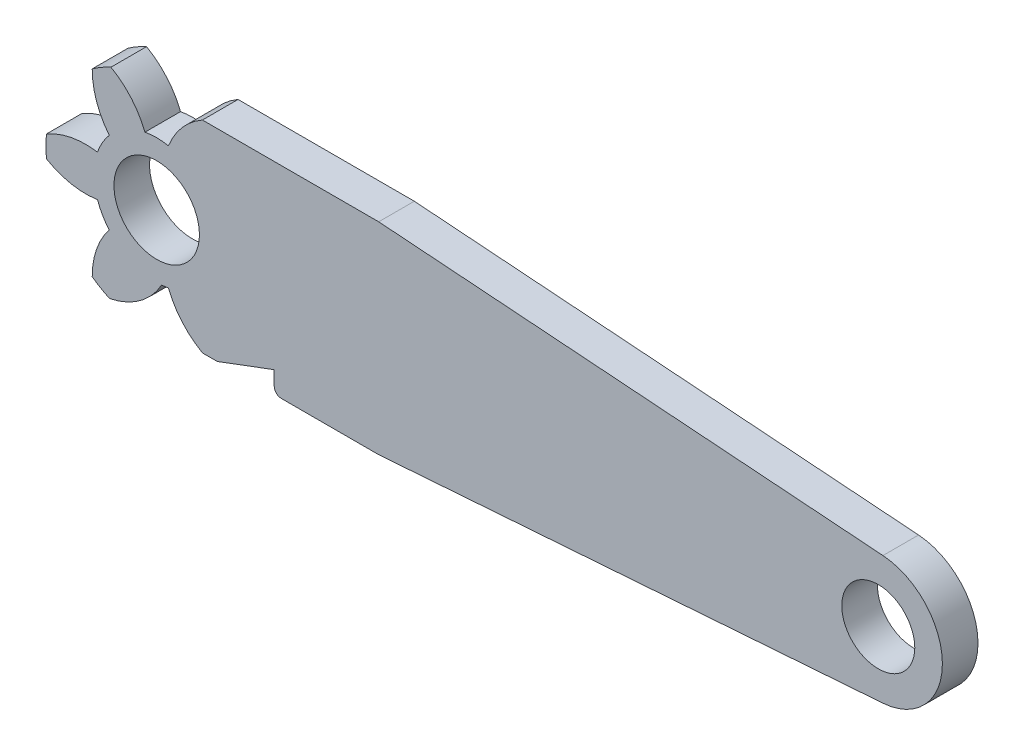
ISO-10303-21;
HEADER;
FILE_DESCRIPTION(('STEP AP214'),'2;1');
FILE_NAME('part.step','',(''),(''),'','','');
FILE_SCHEMA(('AUTOMOTIVE_DESIGN { 1 0 10303 214 1 1 1 1 }'));
ENDSEC;
DATA;
#1=APPLICATION_CONTEXT('core data for automotive mechanical design processes');
#2=APPLICATION_PROTOCOL_DEFINITION('international standard','automotive_design',2000,#1);
#3=PRODUCT_CONTEXT('',#1,'mechanical');
#4=PRODUCT('Part','Part','',(#3));
#5=PRODUCT_RELATED_PRODUCT_CATEGORY('part','',(#4));
#6=PRODUCT_DEFINITION_FORMATION('','',#4);
#7=PRODUCT_DEFINITION_CONTEXT('part definition',#1,'design');
#8=PRODUCT_DEFINITION('design','',#6,#7);
#9=PRODUCT_DEFINITION_SHAPE('','',#8);
#10=(LENGTH_UNIT() NAMED_UNIT(*) SI_UNIT(.MILLI.,.METRE.));
#11=(NAMED_UNIT(*) PLANE_ANGLE_UNIT() SI_UNIT($,.RADIAN.));
#12=(NAMED_UNIT(*) SI_UNIT($,.STERADIAN.) SOLID_ANGLE_UNIT());
#13=UNCERTAINTY_MEASURE_WITH_UNIT(LENGTH_MEASURE(1.E-05),#10,'distance_accuracy_value','');
#14=(GEOMETRIC_REPRESENTATION_CONTEXT(3) GLOBAL_UNCERTAINTY_ASSIGNED_CONTEXT((#13)) GLOBAL_UNIT_ASSIGNED_CONTEXT((#10,
#11,#12)) REPRESENTATION_CONTEXT('',''));
#15=CARTESIAN_POINT('',(0.,0.,0.));
#16=DIRECTION('',(0.,0.,1.));
#17=DIRECTION('',(1.,0.,0.));
#18=AXIS2_PLACEMENT_3D('',#15,#16,#17);
#19=CARTESIAN_POINT('',(82.8787948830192,208.830726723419,5.));
#20=DIRECTION('',(0.,0.,1.));
#21=DIRECTION('',(1.,0.,0.));
#22=AXIS2_PLACEMENT_3D('',#19,#20,#21);
#23=PLANE('',#22);
#24=CARTESIAN_POINT('',(82.8787948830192,208.830726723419,5.));
#25=DIRECTION('',(0.,0.,1.));
#26=DIRECTION('',(1.,0.,0.));
#27=AXIS2_PLACEMENT_3D('',#24,#25,#26);
#28=CIRCLE('',#27,6.00000000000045);
#29=CARTESIAN_POINT('',(88.8787948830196,208.830726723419,5.));
#30=VERTEX_POINT('',#29);
#31=EDGE_CURVE('E248',#30,#30,#28,.T.);
#32=ORIENTED_EDGE('',*,*,#31,.F.);
#33=EDGE_LOOP('',(#32));
#34=FACE_BOUND('',#33,.T.);
#35=CARTESIAN_POINT('',(82.8787948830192,208.830726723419,5.));
#36=DIRECTION('',(0.,0.,1.));
#37=DIRECTION('',(1.,0.,0.));
#38=AXIS2_PLACEMENT_3D('',#35,#36,#37);
#39=CIRCLE('',#38,8.79739096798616);
#40=CARTESIAN_POINT('',(84.5313628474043,217.471508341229,5.));
#41=VERTEX_POINT('',#40);
#42=CARTESIAN_POINT('',(81.2262269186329,217.47150834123,5.));
#43=VERTEX_POINT('',#42);
#44=EDGE_CURVE('E315',#41,#43,#39,.T.);
#45=ORIENTED_EDGE('',*,*,#44,.T.);
#46=CARTESIAN_POINT('',(71.0443966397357,213.49267407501,5.));
#47=DIRECTION('',(0.,0.,1.));
#48=DIRECTION('',(1.,0.,0.));
#49=AXIS2_PLACEMENT_3D('',#46,#47,#48);
#50=CIRCLE('',#49,10.9316416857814);
#51=CARTESIAN_POINT('',(76.4573804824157,222.990062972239,5.));
#52=VERTEX_POINT('',#51);
#53=EDGE_CURVE('E154',#43,#52,#50,.T.);
#54=ORIENTED_EDGE('',*,*,#53,.T.);
#55=CARTESIAN_POINT('',(82.8787948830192,208.830726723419,5.));
#56=DIRECTION('',(0.,0.,1.));
#57=DIRECTION('',(1.,0.,0.));
#58=AXIS2_PLACEMENT_3D('',#55,#56,#57);
#59=CIRCLE('',#58,15.5473909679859);
#60=CARTESIAN_POINT('',(73.8271571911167,221.471502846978,5.));
#61=VERTEX_POINT('',#60);
#62=EDGE_CURVE('E400',#52,#61,#59,.T.);
#63=ORIENTED_EDGE('',*,*,#62,.T.);
#64=CARTESIAN_POINT('',(84.7586291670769,221.4105899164,5.));
#65=DIRECTION('',(0.,0.,1.));
#66=DIRECTION('',(1.,0.,0.));
#67=AXIS2_PLACEMENT_3D('',#64,#65,#66);
#68=CIRCLE('',#67,10.9316416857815);
#69=CARTESIAN_POINT('',(76.2219424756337,214.582283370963,5.));
#70=VERTEX_POINT('',#69);
#71=EDGE_CURVE('E420',#61,#70,#68,.T.);
#72=ORIENTED_EDGE('',*,*,#71,.T.);
#73=CARTESIAN_POINT('',(82.8787948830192,208.830726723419,5.));
#74=DIRECTION('',(0.,0.,1.));
#75=DIRECTION('',(1.,0.,0.));
#76=AXIS2_PLACEMENT_3D('',#73,#74,#75);
#77=CIRCLE('',#76,8.79739096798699);
#78=CARTESIAN_POINT('',(74.569374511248,211.719951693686,5.));
#79=VERTEX_POINT('',#78);
#80=EDGE_CURVE('E416',#70,#79,#77,.T.);
#81=ORIENTED_EDGE('',*,*,#80,.T.);
#82=CARTESIAN_POINT('',(72.924230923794,200.91281088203,5.));
#83=DIRECTION('',(0.,0.,1.));
#84=DIRECTION('',(1.,0.,0.));
#85=AXIS2_PLACEMENT_3D('',#82,#83,#84);
#86=CIRCLE('',#85,10.9316416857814);
#87=CARTESIAN_POINT('',(67.4057427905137,210.349286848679,5.));
#88=VERTEX_POINT('',#87);
#89=EDGE_CURVE('E419',#79,#88,#86,.T.);
#90=ORIENTED_EDGE('',*,*,#89,.T.);
#91=CARTESIAN_POINT('',(82.8787948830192,208.830726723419,5.));
#92=DIRECTION('',(0.,0.,1.));
#93=DIRECTION('',(1.,0.,0.));
#94=AXIS2_PLACEMENT_3D('',#91,#92,#93);
#95=CIRCLE('',#94,15.5473909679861);
#96=CARTESIAN_POINT('',(67.4057427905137,207.312166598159,5.));
#97=VERTEX_POINT('',#96);
#98=EDGE_CURVE('E424',#88,#97,#95,.T.);
#99=ORIENTED_EDGE('',*,*,#98,.T.);
#100=CARTESIAN_POINT('',(72.924230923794,216.748642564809,5.));
#101=DIRECTION('',(0.,0.,1.));
#102=DIRECTION('',(1.,0.,0.));
#103=AXIS2_PLACEMENT_3D('',#100,#101,#102);
#104=CIRCLE('',#103,10.9316416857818);
#105=CARTESIAN_POINT('',(74.5693745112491,205.941501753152,5.));
#106=VERTEX_POINT('',#105);
#107=EDGE_CURVE('E431',#97,#106,#104,.T.);
#108=ORIENTED_EDGE('',*,*,#107,.T.);
#109=CARTESIAN_POINT('',(82.8787948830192,208.830726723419,5.));
#110=DIRECTION('',(0.,0.,1.));
#111=DIRECTION('',(1.,0.,0.));
#112=AXIS2_PLACEMENT_3D('',#109,#110,#111);
#113=CIRCLE('',#112,8.79739096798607);
#114=CARTESIAN_POINT('',(76.2219424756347,203.079170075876,5.));
#115=VERTEX_POINT('',#114);
#116=EDGE_CURVE('E434',#106,#115,#113,.T.);
#117=ORIENTED_EDGE('',*,*,#116,.T.);
#118=CARTESIAN_POINT('',(84.7586291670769,196.250863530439,5.));
#119=DIRECTION('',(0.,0.,1.));
#120=DIRECTION('',(1.,0.,0.));
#121=AXIS2_PLACEMENT_3D('',#118,#119,#120);
#122=CIRCLE('',#121,10.9316416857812);
#123=CARTESIAN_POINT('',(73.827157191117,196.18995059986,5.));
#124=VERTEX_POINT('',#123);
#125=EDGE_CURVE('E437',#115,#124,#122,.T.);
#126=ORIENTED_EDGE('',*,*,#125,.T.);
#127=CARTESIAN_POINT('',(82.8787948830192,208.830726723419,5.));
#128=DIRECTION('',(0.,0.,1.));
#129=DIRECTION('',(1.,0.,0.));
#130=AXIS2_PLACEMENT_3D('',#127,#128,#129);
#131=CIRCLE('',#130,15.5473909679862);
#132=CARTESIAN_POINT('',(76.2561859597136,194.764369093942,5.));
#133=VERTEX_POINT('',#132);
#134=EDGE_CURVE('E440',#124,#133,#131,.T.);
#135=ORIENTED_EDGE('',*,*,#134,.T.);
#136=CARTESIAN_POINT('',(74.165368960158,205.360051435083,5.));
#137=DIRECTION('',(0.,0.,1.));
#138=DIRECTION('',(1.,0.,0.));
#139=AXIS2_PLACEMENT_3D('',#136,#137,#138);
#140=CIRCLE('',#139,10.8);
#141=CARTESIAN_POINT('',(83.5760081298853,200.06100714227,5.));
#142=VERTEX_POINT('',#141);
#143=EDGE_CURVE('E443',#133,#142,#140,.T.);
#144=ORIENTED_EDGE('',*,*,#143,.T.);
#145=CARTESIAN_POINT('',(82.8787948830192,208.830726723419,5.));
#146=DIRECTION('',(0.,0.,1.));
#147=DIRECTION('',(1.,0.,0.));
#148=AXIS2_PLACEMENT_3D('',#145,#146,#147);
#149=CIRCLE('',#148,8.79739096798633);
#150=CARTESIAN_POINT('',(84.5313628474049,200.189945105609,5.));
#151=VERTEX_POINT('',#150);
#152=EDGE_CURVE('E446',#142,#151,#149,.T.);
#153=ORIENTED_EDGE('',*,*,#152,.T.);
#154=CARTESIAN_POINT('',(94.7131931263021,204.168779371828,5.));
#155=DIRECTION('',(0.,0.,1.));
#156=DIRECTION('',(1.,0.,0.));
#157=AXIS2_PLACEMENT_3D('',#154,#155,#156);
#158=CIRCLE('',#157,10.9316416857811);
#159=CARTESIAN_POINT('',(89.3002092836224,194.671390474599,5.));
#160=VERTEX_POINT('',#159);
#161=EDGE_CURVE('E449',#151,#160,#158,.T.);
#162=ORIENTED_EDGE('',*,*,#161,.T.);
#163=DIRECTION('',(1.,0.,0.));
#164=VECTOR('',#163,1.);
#165=CARTESIAN_POINT('',(89.3002092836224,194.671390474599,5.));
#166=LINE('',#165,#164);
#167=CARTESIAN_POINT('',(91.3801110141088,194.671390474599,5.));
#168=VERTEX_POINT('',#167);
#169=EDGE_CURVE('E452',#160,#168,#166,.T.);
#170=ORIENTED_EDGE('',*,*,#169,.T.);
#171=DIRECTION('',(0.936329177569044,0.351123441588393,0.));
#172=VECTOR('',#171,1.);
#173=CARTESIAN_POINT('',(99.3801110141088,197.671390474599,5.));
#174=LINE('',#173,#172);
#175=CARTESIAN_POINT('',(99.3801110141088,197.671390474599,5.));
#176=VERTEX_POINT('',#175);
#177=EDGE_CURVE('E455',#168,#176,#174,.T.);
#178=ORIENTED_EDGE('',*,*,#177,.T.);
#179=DIRECTION('',(0.,-1.,0.));
#180=VECTOR('',#179,1.);
#181=CARTESIAN_POINT('',(99.3801110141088,197.671390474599,5.));
#182=LINE('',#181,#180);
#183=CARTESIAN_POINT('',(99.3801110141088,195.671390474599,5.));
#184=VERTEX_POINT('',#183);
#185=EDGE_CURVE('E458',#176,#184,#182,.T.);
#186=ORIENTED_EDGE('',*,*,#185,.T.);
#187=CARTESIAN_POINT('',(100.380111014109,195.671390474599,5.));
#188=DIRECTION('',(0.,0.,1.));
#189=DIRECTION('',(1.,0.,0.));
#190=AXIS2_PLACEMENT_3D('',#187,#188,#189);
#191=CIRCLE('',#190,1.);
#192=CARTESIAN_POINT('',(100.380111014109,194.671390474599,5.));
#193=VERTEX_POINT('',#192);
#194=EDGE_CURVE('E461',#184,#193,#191,.T.);
#195=ORIENTED_EDGE('',*,*,#194,.T.);
#196=DIRECTION('',(1.,0.,0.));
#197=VECTOR('',#196,1.);
#198=CARTESIAN_POINT('',(100.380111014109,194.671390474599,5.));
#199=LINE('',#198,#197);
#200=CARTESIAN_POINT('',(114.048794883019,194.671390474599,5.));
#201=VERTEX_POINT('',#200);
#202=EDGE_CURVE('E464',#193,#201,#199,.T.);
#203=ORIENTED_EDGE('',*,*,#202,.T.);
#204=DIRECTION('',(0.997330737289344,0.0730164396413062,0.));
#205=VECTOR('',#204,1.);
#206=CARTESIAN_POINT('',(114.048794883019,194.671390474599,5.));
#207=LINE('',#206,#205);
#208=CARTESIAN_POINT('',(184.841758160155,199.854275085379,5.));
#209=VERTEX_POINT('',#208);
#210=EDGE_CURVE('E467',#201,#209,#207,.T.);
#211=ORIENTED_EDGE('',*,*,#210,.T.);
#212=CARTESIAN_POINT('',(184.184610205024,208.830251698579,5.));
#213=DIRECTION('',(0.,0.,1.));
#214=DIRECTION('',(1.,0.,0.));
#215=AXIS2_PLACEMENT_3D('',#212,#213,#214);
#216=CIRCLE('',#215,8.99999997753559);
#217=CARTESIAN_POINT('',(184.841758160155,217.806228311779,5.));
#218=VERTEX_POINT('',#217);
#219=EDGE_CURVE('E221',#209,#218,#216,.T.);
#220=ORIENTED_EDGE('',*,*,#219,.T.);
#221=DIRECTION('',(-0.997330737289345,0.0730164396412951,0.));
#222=VECTOR('',#221,1.);
#223=CARTESIAN_POINT('',(114.048794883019,222.989112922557,5.));
#224=LINE('',#223,#222);
#225=CARTESIAN_POINT('',(114.048794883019,222.989112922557,5.));
#226=VERTEX_POINT('',#225);
#227=EDGE_CURVE('E215',#218,#226,#224,.T.);
#228=ORIENTED_EDGE('',*,*,#227,.T.);
#229=DIRECTION('',(-0.999999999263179,3.83880394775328E-05,0.));
#230=VECTOR('',#229,1.);
#231=CARTESIAN_POINT('',(114.048794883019,222.989112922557,5.));
#232=LINE('',#231,#230);
#233=CARTESIAN_POINT('',(89.3002092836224,222.990062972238,5.));
#234=VERTEX_POINT('',#233);
#235=EDGE_CURVE('E219',#226,#234,#232,.T.);
#236=ORIENTED_EDGE('',*,*,#235,.T.);
#237=CARTESIAN_POINT('',(94.7131931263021,213.49267407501,5.));
#238=DIRECTION('',(0.,0.,1.));
#239=DIRECTION('',(1.,0.,0.));
#240=AXIS2_PLACEMENT_3D('',#237,#238,#239);
#241=CIRCLE('',#240,10.9316416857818);
#242=EDGE_CURVE('E63',#234,#41,#241,.T.);
#243=ORIENTED_EDGE('',*,*,#242,.T.);
#244=EDGE_LOOP('',(#45,#54,#63,#72,#81,#90,#99,#108,#117,#126,#135,#144,#153,#162,#170,#178,
#186,#195,#203,#211,#220,#228,#236,#243));
#245=FACE_BOUND('',#244,.T.);
#246=CARTESIAN_POINT('',(184.184610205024,208.830251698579,5.));
#247=DIRECTION('',(0.,0.,1.));
#248=DIRECTION('',(1.,0.,0.));
#249=AXIS2_PLACEMENT_3D('',#246,#247,#248);
#250=CIRCLE('',#249,5.12499999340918);
#251=CARTESIAN_POINT('',(189.309610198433,208.830251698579,5.));
#252=VERTEX_POINT('',#251);
#253=EDGE_CURVE('E511',#252,#252,#250,.T.);
#254=ORIENTED_EDGE('',*,*,#253,.F.);
#255=EDGE_LOOP('',(#254));
#256=FACE_BOUND('',#255,.T.);
#257=ADVANCED_FACE('F45',(#34,#245,#256),#23,.T.);
#258=CARTESIAN_POINT('',(82.8787948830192,208.830726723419,0.));
#259=DIRECTION('',(0.,0.,1.));
#260=DIRECTION('',(1.,0.,0.));
#261=AXIS2_PLACEMENT_3D('',#258,#259,#260);
#262=PLANE('',#261);
#263=CARTESIAN_POINT('',(82.8787948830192,208.830726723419,0.));
#264=DIRECTION('',(0.,0.,1.));
#265=DIRECTION('',(1.,0.,0.));
#266=AXIS2_PLACEMENT_3D('',#263,#264,#265);
#267=CIRCLE('',#266,8.79739096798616);
#268=CARTESIAN_POINT('',(84.5313628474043,217.471508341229,0.));
#269=VERTEX_POINT('',#268);
#270=CARTESIAN_POINT('',(81.2262269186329,217.47150834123,0.));
#271=VERTEX_POINT('',#270);
#272=EDGE_CURVE('E243',#269,#271,#267,.T.);
#273=ORIENTED_EDGE('',*,*,#272,.F.);
#274=CARTESIAN_POINT('',(94.7131931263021,213.49267407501,0.));
#275=DIRECTION('',(0.,0.,1.));
#276=DIRECTION('',(1.,0.,0.));
#277=AXIS2_PLACEMENT_3D('',#274,#275,#276);
#278=CIRCLE('',#277,10.9316416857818);
#279=CARTESIAN_POINT('',(89.3002092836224,222.990062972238,0.));
#280=VERTEX_POINT('',#279);
#281=EDGE_CURVE('E146',#280,#269,#278,.T.);
#282=ORIENTED_EDGE('',*,*,#281,.F.);
#283=DIRECTION('',(-0.999999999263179,3.83880394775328E-05,0.));
#284=VECTOR('',#283,1.);
#285=CARTESIAN_POINT('',(114.048794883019,222.989112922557,0.));
#286=LINE('',#285,#284);
#287=CARTESIAN_POINT('',(114.048794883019,222.989112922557,0.));
#288=VERTEX_POINT('',#287);
#289=EDGE_CURVE('E140',#288,#280,#286,.T.);
#290=ORIENTED_EDGE('',*,*,#289,.F.);
#291=DIRECTION('',(-0.997330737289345,0.0730164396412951,0.));
#292=VECTOR('',#291,1.);
#293=CARTESIAN_POINT('',(114.048794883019,222.989112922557,0.));
#294=LINE('',#293,#292);
#295=CARTESIAN_POINT('',(184.841758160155,217.806228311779,0.));
#296=VERTEX_POINT('',#295);
#297=EDGE_CURVE('E230',#296,#288,#294,.T.);
#298=ORIENTED_EDGE('',*,*,#297,.F.);
#299=CARTESIAN_POINT('',(184.184610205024,208.830251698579,0.));
#300=DIRECTION('',(0.,0.,1.));
#301=DIRECTION('',(1.,0.,0.));
#302=AXIS2_PLACEMENT_3D('',#299,#300,#301);
#303=CIRCLE('',#302,8.99999997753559);
#304=CARTESIAN_POINT('',(184.841758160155,199.854275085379,0.));
#305=VERTEX_POINT('',#304);
#306=EDGE_CURVE('E306',#305,#296,#303,.T.);
#307=ORIENTED_EDGE('',*,*,#306,.F.);
#308=DIRECTION('',(0.997330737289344,0.0730164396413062,0.));
#309=VECTOR('',#308,1.);
#310=CARTESIAN_POINT('',(114.048794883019,194.671390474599,0.));
#311=LINE('',#310,#309);
#312=CARTESIAN_POINT('',(114.048794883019,194.671390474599,0.));
#313=VERTEX_POINT('',#312);
#314=EDGE_CURVE('E303',#313,#305,#311,.T.);
#315=ORIENTED_EDGE('',*,*,#314,.F.);
#316=DIRECTION('',(1.,0.,0.));
#317=VECTOR('',#316,1.);
#318=CARTESIAN_POINT('',(100.380111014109,194.671390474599,0.));
#319=LINE('',#318,#317);
#320=CARTESIAN_POINT('',(100.380111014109,194.671390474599,0.));
#321=VERTEX_POINT('',#320);
#322=EDGE_CURVE('E300',#321,#313,#319,.T.);
#323=ORIENTED_EDGE('',*,*,#322,.F.);
#324=CARTESIAN_POINT('',(100.380111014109,195.671390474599,0.));
#325=DIRECTION('',(0.,0.,1.));
#326=DIRECTION('',(1.,0.,0.));
#327=AXIS2_PLACEMENT_3D('',#324,#325,#326);
#328=CIRCLE('',#327,1.);
#329=CARTESIAN_POINT('',(99.3801110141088,195.671390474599,0.));
#330=VERTEX_POINT('',#329);
#331=EDGE_CURVE('E297',#330,#321,#328,.T.);
#332=ORIENTED_EDGE('',*,*,#331,.F.);
#333=DIRECTION('',(0.,-1.,0.));
#334=VECTOR('',#333,1.);
#335=CARTESIAN_POINT('',(99.3801110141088,196.949890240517,0.));
#336=LINE('',#335,#334);
#337=CARTESIAN_POINT('',(99.3801110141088,197.671390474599,0.));
#338=VERTEX_POINT('',#337);
#339=EDGE_CURVE('E294',#338,#330,#336,.T.);
#340=ORIENTED_EDGE('',*,*,#339,.F.);
#341=DIRECTION('',(0.936329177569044,0.351123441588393,0.));
#342=VECTOR('',#341,1.);
#343=CARTESIAN_POINT('',(99.3801110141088,197.671390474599,0.));
#344=LINE('',#343,#342);
#345=CARTESIAN_POINT('',(91.3801110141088,194.671390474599,0.));
#346=VERTEX_POINT('',#345);
#347=EDGE_CURVE('E290',#346,#338,#344,.T.);
#348=ORIENTED_EDGE('',*,*,#347,.F.);
#349=DIRECTION('',(1.,0.,0.));
#350=VECTOR('',#349,1.);
#351=CARTESIAN_POINT('',(89.3002092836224,194.671390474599,0.));
#352=LINE('',#351,#350);
#353=CARTESIAN_POINT('',(89.3002092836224,194.671390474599,0.));
#354=VERTEX_POINT('',#353);
#355=EDGE_CURVE('E287',#354,#346,#352,.T.);
#356=ORIENTED_EDGE('',*,*,#355,.F.);
#357=CARTESIAN_POINT('',(94.7131931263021,204.168779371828,0.));
#358=DIRECTION('',(0.,0.,1.));
#359=DIRECTION('',(1.,0.,0.));
#360=AXIS2_PLACEMENT_3D('',#357,#358,#359);
#361=CIRCLE('',#360,10.9316416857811);
#362=CARTESIAN_POINT('',(84.5313628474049,200.189945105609,0.));
#363=VERTEX_POINT('',#362);
#364=EDGE_CURVE('E284',#363,#354,#361,.T.);
#365=ORIENTED_EDGE('',*,*,#364,.F.);
#366=CARTESIAN_POINT('',(82.8787948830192,208.830726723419,0.));
#367=DIRECTION('',(0.,0.,1.));
#368=DIRECTION('',(1.,0.,0.));
#369=AXIS2_PLACEMENT_3D('',#366,#367,#368);
#370=CIRCLE('',#369,8.79739096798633);
#371=CARTESIAN_POINT('',(83.5760081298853,200.06100714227,0.));
#372=VERTEX_POINT('',#371);
#373=EDGE_CURVE('E281',#372,#363,#370,.T.);
#374=ORIENTED_EDGE('',*,*,#373,.F.);
#375=CARTESIAN_POINT('',(74.165368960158,205.360051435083,0.));
#376=DIRECTION('',(0.,0.,1.));
#377=DIRECTION('',(1.,0.,0.));
#378=AXIS2_PLACEMENT_3D('',#375,#376,#377);
#379=CIRCLE('',#378,10.8);
#380=CARTESIAN_POINT('',(76.2561859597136,194.764369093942,0.));
#381=VERTEX_POINT('',#380);
#382=EDGE_CURVE('E278',#381,#372,#379,.T.);
#383=ORIENTED_EDGE('',*,*,#382,.F.);
#384=CARTESIAN_POINT('',(82.8787948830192,208.830726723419,0.));
#385=DIRECTION('',(0.,0.,1.));
#386=DIRECTION('',(1.,0.,0.));
#387=AXIS2_PLACEMENT_3D('',#384,#385,#386);
#388=CIRCLE('',#387,15.5473909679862);
#389=CARTESIAN_POINT('',(73.827157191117,196.18995059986,0.));
#390=VERTEX_POINT('',#389);
#391=EDGE_CURVE('E275',#390,#381,#388,.T.);
#392=ORIENTED_EDGE('',*,*,#391,.F.);
#393=CARTESIAN_POINT('',(84.7586291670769,196.250863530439,0.));
#394=DIRECTION('',(0.,0.,1.));
#395=DIRECTION('',(1.,0.,0.));
#396=AXIS2_PLACEMENT_3D('',#393,#394,#395);
#397=CIRCLE('',#396,10.9316416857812);
#398=CARTESIAN_POINT('',(76.2219424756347,203.079170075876,0.));
#399=VERTEX_POINT('',#398);
#400=EDGE_CURVE('E272',#399,#390,#397,.T.);
#401=ORIENTED_EDGE('',*,*,#400,.F.);
#402=CARTESIAN_POINT('',(82.8787948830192,208.830726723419,0.));
#403=DIRECTION('',(0.,0.,1.));
#404=DIRECTION('',(1.,0.,0.));
#405=AXIS2_PLACEMENT_3D('',#402,#403,#404);
#406=CIRCLE('',#405,8.79739096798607);
#407=CARTESIAN_POINT('',(74.5693745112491,205.941501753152,0.));
#408=VERTEX_POINT('',#407);
#409=EDGE_CURVE('E269',#408,#399,#406,.T.);
#410=ORIENTED_EDGE('',*,*,#409,.F.);
#411=CARTESIAN_POINT('',(72.924230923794,216.748642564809,0.));
#412=DIRECTION('',(0.,0.,1.));
#413=DIRECTION('',(1.,0.,0.));
#414=AXIS2_PLACEMENT_3D('',#411,#412,#413);
#415=CIRCLE('',#414,10.9316416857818);
#416=CARTESIAN_POINT('',(67.4057427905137,207.312166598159,0.));
#417=VERTEX_POINT('',#416);
#418=EDGE_CURVE('E266',#417,#408,#415,.T.);
#419=ORIENTED_EDGE('',*,*,#418,.F.);
#420=CARTESIAN_POINT('',(82.8787948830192,208.830726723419,0.));
#421=DIRECTION('',(0.,0.,1.));
#422=DIRECTION('',(1.,0.,0.));
#423=AXIS2_PLACEMENT_3D('',#420,#421,#422);
#424=CIRCLE('',#423,15.5473909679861);
#425=CARTESIAN_POINT('',(67.4057427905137,210.349286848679,0.));
#426=VERTEX_POINT('',#425);
#427=EDGE_CURVE('E263',#426,#417,#424,.T.);
#428=ORIENTED_EDGE('',*,*,#427,.F.);
#429=CARTESIAN_POINT('',(72.924230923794,200.91281088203,0.));
#430=DIRECTION('',(0.,0.,1.));
#431=DIRECTION('',(1.,0.,0.));
#432=AXIS2_PLACEMENT_3D('',#429,#430,#431);
#433=CIRCLE('',#432,10.9316416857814);
#434=CARTESIAN_POINT('',(74.569374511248,211.719951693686,0.));
#435=VERTEX_POINT('',#434);
#436=EDGE_CURVE('E260',#435,#426,#433,.T.);
#437=ORIENTED_EDGE('',*,*,#436,.F.);
#438=CARTESIAN_POINT('',(82.8787948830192,208.830726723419,0.));
#439=DIRECTION('',(0.,0.,1.));
#440=DIRECTION('',(1.,0.,0.));
#441=AXIS2_PLACEMENT_3D('',#438,#439,#440);
#442=CIRCLE('',#441,8.79739096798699);
#443=CARTESIAN_POINT('',(76.2219424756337,214.582283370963,0.));
#444=VERTEX_POINT('',#443);
#445=EDGE_CURVE('E257',#444,#435,#442,.T.);
#446=ORIENTED_EDGE('',*,*,#445,.F.);
#447=CARTESIAN_POINT('',(84.7586291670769,221.4105899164,0.));
#448=DIRECTION('',(0.,0.,1.));
#449=DIRECTION('',(1.,0.,0.));
#450=AXIS2_PLACEMENT_3D('',#447,#448,#449);
#451=CIRCLE('',#450,10.9316416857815);
#452=CARTESIAN_POINT('',(73.8271571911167,221.471502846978,0.));
#453=VERTEX_POINT('',#452);
#454=EDGE_CURVE('E254',#453,#444,#451,.T.);
#455=ORIENTED_EDGE('',*,*,#454,.F.);
#456=CARTESIAN_POINT('',(82.8787948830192,208.830726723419,0.));
#457=DIRECTION('',(0.,0.,1.));
#458=DIRECTION('',(1.,0.,0.));
#459=AXIS2_PLACEMENT_3D('',#456,#457,#458);
#460=CIRCLE('',#459,15.5473909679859);
#461=CARTESIAN_POINT('',(76.4573804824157,222.990062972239,0.));
#462=VERTEX_POINT('',#461);
#463=EDGE_CURVE('E251',#462,#453,#460,.T.);
#464=ORIENTED_EDGE('',*,*,#463,.F.);
#465=CARTESIAN_POINT('',(71.0443966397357,213.49267407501,0.));
#466=DIRECTION('',(0.,0.,1.));
#467=DIRECTION('',(1.,0.,0.));
#468=AXIS2_PLACEMENT_3D('',#465,#466,#467);
#469=CIRCLE('',#468,10.9316416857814);
#470=EDGE_CURVE('E247',#271,#462,#469,.T.);
#471=ORIENTED_EDGE('',*,*,#470,.F.);
#472=EDGE_LOOP('',(#273,#282,#290,#298,#307,#315,#323,#332,#340,#348,#356,#365,#374,#383,#392,
#401,#410,#419,#428,#437,#446,#455,#464,#471));
#473=FACE_BOUND('',#472,.T.);
#474=CARTESIAN_POINT('',(82.8787948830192,208.830726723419,0.));
#475=DIRECTION('',(0.,0.,1.));
#476=DIRECTION('',(1.,0.,0.));
#477=AXIS2_PLACEMENT_3D('',#474,#475,#476);
#478=CIRCLE('',#477,6.00000000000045);
#479=CARTESIAN_POINT('',(88.8787948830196,208.830726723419,0.));
#480=VERTEX_POINT('',#479);
#481=EDGE_CURVE('E519',#480,#480,#478,.T.);
#482=ORIENTED_EDGE('',*,*,#481,.T.);
#483=EDGE_LOOP('',(#482));
#484=FACE_BOUND('',#483,.T.);
#485=CARTESIAN_POINT('',(184.184610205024,208.830251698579,0.));
#486=DIRECTION('',(0.,0.,1.));
#487=DIRECTION('',(1.,0.,0.));
#488=AXIS2_PLACEMENT_3D('',#485,#486,#487);
#489=CIRCLE('',#488,5.12499999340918);
#490=CARTESIAN_POINT('',(189.309610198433,208.830251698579,0.));
#491=VERTEX_POINT('',#490);
#492=EDGE_CURVE('E514',#491,#491,#489,.T.);
#493=ORIENTED_EDGE('',*,*,#492,.T.);
#494=EDGE_LOOP('',(#493));
#495=FACE_BOUND('',#494,.T.);
#496=ADVANCED_FACE('F404',(#473,#484,#495),#262,.F.);
#497=CARTESIAN_POINT('',(82.8787948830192,208.830726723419,5.));
#498=DIRECTION('',(0.,0.,-1.));
#499=DIRECTION('',(-1.,0.,0.));
#500=AXIS2_PLACEMENT_3D('',#497,#498,#499);
#501=CYLINDRICAL_SURFACE('',#500,8.79739096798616);
#502=ORIENTED_EDGE('',*,*,#272,.T.);
#503=DIRECTION('',(0.,0.,-1.));
#504=VECTOR('',#503,1.);
#505=CARTESIAN_POINT('',(81.2262269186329,217.47150834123,5.));
#506=LINE('',#505,#504);
#507=EDGE_CURVE('E11',#43,#271,#506,.T.);
#508=ORIENTED_EDGE('',*,*,#507,.F.);
#509=ORIENTED_EDGE('',*,*,#44,.F.);
#510=DIRECTION('',(0.,0.,-1.));
#511=VECTOR('',#510,1.);
#512=CARTESIAN_POINT('',(84.5313628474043,217.471508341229,5.));
#513=LINE('',#512,#511);
#514=EDGE_CURVE('E239',#41,#269,#513,.T.);
#515=ORIENTED_EDGE('',*,*,#514,.T.);
#516=EDGE_LOOP('',(#502,#508,#509,#515));
#517=FACE_BOUND('',#516,.T.);
#518=ADVANCED_FACE('F47',(#517),#501,.T.);
#519=CARTESIAN_POINT('',(71.0443966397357,213.49267407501,5.));
#520=DIRECTION('',(0.,0.,-1.));
#521=DIRECTION('',(-1.,0.,0.));
#522=AXIS2_PLACEMENT_3D('',#519,#520,#521);
#523=CYLINDRICAL_SURFACE('',#522,10.9316416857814);
#524=ORIENTED_EDGE('',*,*,#470,.T.);
#525=DIRECTION('',(0.,0.,-1.));
#526=VECTOR('',#525,1.);
#527=CARTESIAN_POINT('',(76.4573804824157,222.990062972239,5.));
#528=LINE('',#527,#526);
#529=EDGE_CURVE('E55',#52,#462,#528,.T.);
#530=ORIENTED_EDGE('',*,*,#529,.F.);
#531=ORIENTED_EDGE('',*,*,#53,.F.);
#532=ORIENTED_EDGE('',*,*,#507,.T.);
#533=EDGE_LOOP('',(#524,#530,#531,#532));
#534=FACE_BOUND('',#533,.T.);
#535=ADVANCED_FACE('F747',(#534),#523,.T.);
#536=CARTESIAN_POINT('',(82.8787948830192,208.830726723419,5.));
#537=DIRECTION('',(0.,0.,-1.));
#538=DIRECTION('',(-1.,0.,0.));
#539=AXIS2_PLACEMENT_3D('',#536,#537,#538);
#540=CYLINDRICAL_SURFACE('',#539,15.5473909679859);
#541=ORIENTED_EDGE('',*,*,#463,.T.);
#542=DIRECTION('',(0.,0.,-1.));
#543=VECTOR('',#542,1.);
#544=CARTESIAN_POINT('',(73.8271571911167,221.471502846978,5.));
#545=LINE('',#544,#543);
#546=EDGE_CURVE('E390',#61,#453,#545,.T.);
#547=ORIENTED_EDGE('',*,*,#546,.F.);
#548=ORIENTED_EDGE('',*,*,#62,.F.);
#549=ORIENTED_EDGE('',*,*,#529,.T.);
#550=EDGE_LOOP('',(#541,#547,#548,#549));
#551=FACE_BOUND('',#550,.T.);
#552=ADVANCED_FACE('F398',(#551),#540,.T.);
#553=CARTESIAN_POINT('',(84.7586291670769,221.4105899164,5.));
#554=DIRECTION('',(0.,0.,-1.));
#555=DIRECTION('',(-1.,0.,0.));
#556=AXIS2_PLACEMENT_3D('',#553,#554,#555);
#557=CYLINDRICAL_SURFACE('',#556,10.9316416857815);
#558=ORIENTED_EDGE('',*,*,#454,.T.);
#559=DIRECTION('',(0.,0.,-1.));
#560=VECTOR('',#559,1.);
#561=CARTESIAN_POINT('',(76.2219424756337,214.582283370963,5.));
#562=LINE('',#561,#560);
#563=EDGE_CURVE('E386',#70,#444,#562,.T.);
#564=ORIENTED_EDGE('',*,*,#563,.F.);
#565=ORIENTED_EDGE('',*,*,#71,.F.);
#566=ORIENTED_EDGE('',*,*,#546,.T.);
#567=EDGE_LOOP('',(#558,#564,#565,#566));
#568=FACE_BOUND('',#567,.T.);
#569=ADVANCED_FACE('F410',(#568),#557,.T.);
#570=CARTESIAN_POINT('',(82.8787948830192,208.830726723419,5.));
#571=DIRECTION('',(0.,0.,-1.));
#572=DIRECTION('',(-1.,0.,0.));
#573=AXIS2_PLACEMENT_3D('',#570,#571,#572);
#574=CYLINDRICAL_SURFACE('',#573,8.79739096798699);
#575=ORIENTED_EDGE('',*,*,#445,.T.);
#576=DIRECTION('',(0.,0.,-1.));
#577=VECTOR('',#576,1.);
#578=CARTESIAN_POINT('',(74.569374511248,211.719951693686,5.));
#579=LINE('',#578,#577);
#580=EDGE_CURVE('E382',#79,#435,#579,.T.);
#581=ORIENTED_EDGE('',*,*,#580,.F.);
#582=ORIENTED_EDGE('',*,*,#80,.F.);
#583=ORIENTED_EDGE('',*,*,#563,.T.);
#584=EDGE_LOOP('',(#575,#581,#582,#583));
#585=FACE_BOUND('',#584,.T.);
#586=ADVANCED_FACE('F414',(#585),#574,.T.);
#587=CARTESIAN_POINT('',(72.924230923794,200.91281088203,5.));
#588=DIRECTION('',(0.,0.,-1.));
#589=DIRECTION('',(-1.,0.,0.));
#590=AXIS2_PLACEMENT_3D('',#587,#588,#589);
#591=CYLINDRICAL_SURFACE('',#590,10.9316416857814);
#592=ORIENTED_EDGE('',*,*,#436,.T.);
#593=DIRECTION('',(0.,0.,-1.));
#594=VECTOR('',#593,1.);
#595=CARTESIAN_POINT('',(67.4057427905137,210.349286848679,5.));
#596=LINE('',#595,#594);
#597=EDGE_CURVE('E378',#88,#426,#596,.T.);
#598=ORIENTED_EDGE('',*,*,#597,.F.);
#599=ORIENTED_EDGE('',*,*,#89,.F.);
#600=ORIENTED_EDGE('',*,*,#580,.T.);
#601=EDGE_LOOP('',(#592,#598,#599,#600));
#602=FACE_BOUND('',#601,.T.);
#603=ADVANCED_FACE('F712',(#602),#591,.T.);
#604=CARTESIAN_POINT('',(82.8787948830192,208.830726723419,5.));
#605=DIRECTION('',(0.,0.,-1.));
#606=DIRECTION('',(-1.,0.,0.));
#607=AXIS2_PLACEMENT_3D('',#604,#605,#606);
#608=CYLINDRICAL_SURFACE('',#607,15.5473909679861);
#609=ORIENTED_EDGE('',*,*,#427,.T.);
#610=DIRECTION('',(0.,0.,-1.));
#611=VECTOR('',#610,1.);
#612=CARTESIAN_POINT('',(67.4057427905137,207.312166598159,5.));
#613=LINE('',#612,#611);
#614=EDGE_CURVE('E374',#97,#417,#613,.T.);
#615=ORIENTED_EDGE('',*,*,#614,.F.);
#616=ORIENTED_EDGE('',*,*,#98,.F.);
#617=ORIENTED_EDGE('',*,*,#597,.T.);
#618=EDGE_LOOP('',(#609,#615,#616,#617));
#619=FACE_BOUND('',#618,.T.);
#620=ADVANCED_FACE('F702',(#619),#608,.T.);
#621=CARTESIAN_POINT('',(72.924230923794,216.748642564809,5.));
#622=DIRECTION('',(0.,0.,-1.));
#623=DIRECTION('',(-1.,0.,0.));
#624=AXIS2_PLACEMENT_3D('',#621,#622,#623);
#625=CYLINDRICAL_SURFACE('',#624,10.9316416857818);
#626=ORIENTED_EDGE('',*,*,#418,.T.);
#627=DIRECTION('',(0.,0.,-1.));
#628=VECTOR('',#627,1.);
#629=CARTESIAN_POINT('',(74.5693745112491,205.941501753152,5.));
#630=LINE('',#629,#628);
#631=EDGE_CURVE('E370',#106,#408,#630,.T.);
#632=ORIENTED_EDGE('',*,*,#631,.F.);
#633=ORIENTED_EDGE('',*,*,#107,.F.);
#634=ORIENTED_EDGE('',*,*,#614,.T.);
#635=EDGE_LOOP('',(#626,#632,#633,#634));
#636=FACE_BOUND('',#635,.T.);
#637=ADVANCED_FACE('F692',(#636),#625,.T.);
#638=CARTESIAN_POINT('',(82.8787948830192,208.830726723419,5.));
#639=DIRECTION('',(0.,0.,-1.));
#640=DIRECTION('',(-1.,0.,0.));
#641=AXIS2_PLACEMENT_3D('',#638,#639,#640);
#642=CYLINDRICAL_SURFACE('',#641,8.79739096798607);
#643=ORIENTED_EDGE('',*,*,#409,.T.);
#644=DIRECTION('',(0.,0.,-1.));
#645=VECTOR('',#644,1.);
#646=CARTESIAN_POINT('',(76.2219424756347,203.079170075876,5.));
#647=LINE('',#646,#645);
#648=EDGE_CURVE('E366',#115,#399,#647,.T.);
#649=ORIENTED_EDGE('',*,*,#648,.F.);
#650=ORIENTED_EDGE('',*,*,#116,.F.);
#651=ORIENTED_EDGE('',*,*,#631,.T.);
#652=EDGE_LOOP('',(#643,#649,#650,#651));
#653=FACE_BOUND('',#652,.T.);
#654=ADVANCED_FACE('F682',(#653),#642,.T.);
#655=CARTESIAN_POINT('',(84.7586291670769,196.250863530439,5.));
#656=DIRECTION('',(0.,0.,-1.));
#657=DIRECTION('',(-1.,0.,0.));
#658=AXIS2_PLACEMENT_3D('',#655,#656,#657);
#659=CYLINDRICAL_SURFACE('',#658,10.9316416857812);
#660=ORIENTED_EDGE('',*,*,#400,.T.);
#661=DIRECTION('',(0.,0.,-1.));
#662=VECTOR('',#661,1.);
#663=CARTESIAN_POINT('',(73.827157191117,196.18995059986,5.));
#664=LINE('',#663,#662);
#665=EDGE_CURVE('E362',#124,#390,#664,.T.);
#666=ORIENTED_EDGE('',*,*,#665,.F.);
#667=ORIENTED_EDGE('',*,*,#125,.F.);
#668=ORIENTED_EDGE('',*,*,#648,.T.);
#669=EDGE_LOOP('',(#660,#666,#667,#668));
#670=FACE_BOUND('',#669,.T.);
#671=ADVANCED_FACE('F672',(#670),#659,.T.);
#672=CARTESIAN_POINT('',(82.8787948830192,208.830726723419,5.));
#673=DIRECTION('',(0.,0.,-1.));
#674=DIRECTION('',(-1.,0.,0.));
#675=AXIS2_PLACEMENT_3D('',#672,#673,#674);
#676=CYLINDRICAL_SURFACE('',#675,15.5473909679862);
#677=ORIENTED_EDGE('',*,*,#391,.T.);
#678=DIRECTION('',(0.,0.,-1.));
#679=VECTOR('',#678,1.);
#680=CARTESIAN_POINT('',(76.2561859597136,194.764369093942,5.));
#681=LINE('',#680,#679);
#682=EDGE_CURVE('E358',#133,#381,#681,.T.);
#683=ORIENTED_EDGE('',*,*,#682,.F.);
#684=ORIENTED_EDGE('',*,*,#134,.F.);
#685=ORIENTED_EDGE('',*,*,#665,.T.);
#686=EDGE_LOOP('',(#677,#683,#684,#685));
#687=FACE_BOUND('',#686,.T.);
#688=ADVANCED_FACE('F662',(#687),#676,.T.);
#689=CARTESIAN_POINT('',(74.165368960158,205.360051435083,5.));
#690=DIRECTION('',(0.,0.,-1.));
#691=DIRECTION('',(-1.,0.,0.));
#692=AXIS2_PLACEMENT_3D('',#689,#690,#691);
#693=CYLINDRICAL_SURFACE('',#692,10.8);
#694=ORIENTED_EDGE('',*,*,#382,.T.);
#695=DIRECTION('',(0.,0.,-1.));
#696=VECTOR('',#695,1.);
#697=CARTESIAN_POINT('',(83.5760081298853,200.06100714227,5.));
#698=LINE('',#697,#696);
#699=EDGE_CURVE('E354',#142,#372,#698,.T.);
#700=ORIENTED_EDGE('',*,*,#699,.F.);
#701=ORIENTED_EDGE('',*,*,#143,.F.);
#702=ORIENTED_EDGE('',*,*,#682,.T.);
#703=EDGE_LOOP('',(#694,#700,#701,#702));
#704=FACE_BOUND('',#703,.T.);
#705=ADVANCED_FACE('F652',(#704),#693,.T.);
#706=CARTESIAN_POINT('',(82.8787948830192,208.830726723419,5.));
#707=DIRECTION('',(0.,0.,-1.));
#708=DIRECTION('',(-1.,0.,0.));
#709=AXIS2_PLACEMENT_3D('',#706,#707,#708);
#710=CYLINDRICAL_SURFACE('',#709,8.79739096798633);
#711=ORIENTED_EDGE('',*,*,#373,.T.);
#712=DIRECTION('',(0.,0.,-1.));
#713=VECTOR('',#712,1.);
#714=CARTESIAN_POINT('',(84.5313628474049,200.189945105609,5.));
#715=LINE('',#714,#713);
#716=EDGE_CURVE('E350',#151,#363,#715,.T.);
#717=ORIENTED_EDGE('',*,*,#716,.F.);
#718=ORIENTED_EDGE('',*,*,#152,.F.);
#719=ORIENTED_EDGE('',*,*,#699,.T.);
#720=EDGE_LOOP('',(#711,#717,#718,#719));
#721=FACE_BOUND('',#720,.T.);
#722=ADVANCED_FACE('F642',(#721),#710,.T.);
#723=CARTESIAN_POINT('',(94.7131931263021,204.168779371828,5.));
#724=DIRECTION('',(0.,0.,-1.));
#725=DIRECTION('',(-1.,0.,0.));
#726=AXIS2_PLACEMENT_3D('',#723,#724,#725);
#727=CYLINDRICAL_SURFACE('',#726,10.9316416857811);
#728=ORIENTED_EDGE('',*,*,#364,.T.);
#729=DIRECTION('',(0.,0.,-1.));
#730=VECTOR('',#729,1.);
#731=CARTESIAN_POINT('',(89.3002092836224,194.671390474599,5.));
#732=LINE('',#731,#730);
#733=EDGE_CURVE('E346',#160,#354,#732,.T.);
#734=ORIENTED_EDGE('',*,*,#733,.F.);
#735=ORIENTED_EDGE('',*,*,#161,.F.);
#736=ORIENTED_EDGE('',*,*,#716,.T.);
#737=EDGE_LOOP('',(#728,#734,#735,#736));
#738=FACE_BOUND('',#737,.T.);
#739=ADVANCED_FACE('F632',(#738),#727,.T.);
#740=CARTESIAN_POINT('',(89.3002092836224,194.671390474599,5.));
#741=DIRECTION('',(0.,1.,0.));
#742=DIRECTION('',(0.,0.,1.));
#743=AXIS2_PLACEMENT_3D('',#740,#741,#742);
#744=PLANE('',#743);
#745=ORIENTED_EDGE('',*,*,#355,.T.);
#746=DIRECTION('',(0.,0.,-1.));
#747=VECTOR('',#746,1.);
#748=CARTESIAN_POINT('',(91.3801110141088,194.671390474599,5.));
#749=LINE('',#748,#747);
#750=EDGE_CURVE('E342',#168,#346,#749,.T.);
#751=ORIENTED_EDGE('',*,*,#750,.F.);
#752=ORIENTED_EDGE('',*,*,#169,.F.);
#753=ORIENTED_EDGE('',*,*,#733,.T.);
#754=EDGE_LOOP('',(#745,#751,#752,#753));
#755=FACE_BOUND('',#754,.T.);
#756=ADVANCED_FACE('F622',(#755),#744,.F.);
#757=CARTESIAN_POINT('',(99.3801110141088,197.671390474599,5.));
#758=DIRECTION('',(-0.351123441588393,0.936329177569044,0.));
#759=DIRECTION('',(-0.936329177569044,-0.351123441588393,0.));
#760=AXIS2_PLACEMENT_3D('',#757,#758,#759);
#761=PLANE('',#760);
#762=ORIENTED_EDGE('',*,*,#347,.T.);
#763=DIRECTION('',(0.,0.,-1.));
#764=VECTOR('',#763,1.);
#765=CARTESIAN_POINT('',(99.3801110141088,197.671390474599,5.));
#766=LINE('',#765,#764);
#767=EDGE_CURVE('E338',#176,#338,#766,.T.);
#768=ORIENTED_EDGE('',*,*,#767,.F.);
#769=ORIENTED_EDGE('',*,*,#177,.F.);
#770=ORIENTED_EDGE('',*,*,#750,.T.);
#771=EDGE_LOOP('',(#762,#768,#769,#770));
#772=FACE_BOUND('',#771,.T.);
#773=ADVANCED_FACE('F613',(#772),#761,.F.);
#774=CARTESIAN_POINT('',(99.3801110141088,196.949890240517,5.));
#775=DIRECTION('',(1.,0.,0.));
#776=DIRECTION('',(0.,1.,0.));
#777=AXIS2_PLACEMENT_3D('',#774,#775,#776);
#778=PLANE('',#777);
#779=ORIENTED_EDGE('',*,*,#339,.T.);
#780=DIRECTION('',(0.,0.,-1.));
#781=VECTOR('',#780,1.);
#782=CARTESIAN_POINT('',(99.3801110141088,195.671390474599,5.));
#783=LINE('',#782,#781);
#784=EDGE_CURVE('E334',#184,#330,#783,.T.);
#785=ORIENTED_EDGE('',*,*,#784,.F.);
#786=ORIENTED_EDGE('',*,*,#185,.F.);
#787=ORIENTED_EDGE('',*,*,#767,.T.);
#788=EDGE_LOOP('',(#779,#785,#786,#787));
#789=FACE_BOUND('',#788,.T.);
#790=ADVANCED_FACE('F602',(#789),#778,.F.);
#791=CARTESIAN_POINT('',(100.380111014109,195.671390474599,5.));
#792=DIRECTION('',(0.,0.,-1.));
#793=DIRECTION('',(-1.,0.,0.));
#794=AXIS2_PLACEMENT_3D('',#791,#792,#793);
#795=CYLINDRICAL_SURFACE('',#794,1.);
#796=ORIENTED_EDGE('',*,*,#331,.T.);
#797=DIRECTION('',(0.,0.,-1.));
#798=VECTOR('',#797,1.);
#799=CARTESIAN_POINT('',(100.380111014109,194.671390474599,5.));
#800=LINE('',#799,#798);
#801=EDGE_CURVE('E330',#193,#321,#800,.T.);
#802=ORIENTED_EDGE('',*,*,#801,.F.);
#803=ORIENTED_EDGE('',*,*,#194,.F.);
#804=ORIENTED_EDGE('',*,*,#784,.T.);
#805=EDGE_LOOP('',(#796,#802,#803,#804));
#806=FACE_BOUND('',#805,.T.);
#807=ADVANCED_FACE('F592',(#806),#795,.T.);
#808=CARTESIAN_POINT('',(100.380111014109,194.671390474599,5.));
#809=DIRECTION('',(0.,1.,0.));
#810=DIRECTION('',(0.,0.,1.));
#811=AXIS2_PLACEMENT_3D('',#808,#809,#810);
#812=PLANE('',#811);
#813=ORIENTED_EDGE('',*,*,#322,.T.);
#814=DIRECTION('',(0.,0.,-1.));
#815=VECTOR('',#814,1.);
#816=CARTESIAN_POINT('',(114.048794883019,194.671390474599,5.));
#817=LINE('',#816,#815);
#818=EDGE_CURVE('E326',#201,#313,#817,.T.);
#819=ORIENTED_EDGE('',*,*,#818,.F.);
#820=ORIENTED_EDGE('',*,*,#202,.F.);
#821=ORIENTED_EDGE('',*,*,#801,.T.);
#822=EDGE_LOOP('',(#813,#819,#820,#821));
#823=FACE_BOUND('',#822,.T.);
#824=ADVANCED_FACE('F583',(#823),#812,.F.);
#825=CARTESIAN_POINT('',(114.048794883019,194.671390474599,5.));
#826=DIRECTION('',(-0.0730164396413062,0.997330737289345,0.));
#827=DIRECTION('',(-0.997330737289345,-0.0730164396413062,0.));
#828=AXIS2_PLACEMENT_3D('',#825,#826,#827);
#829=PLANE('',#828);
#830=ORIENTED_EDGE('',*,*,#314,.T.);
#831=DIRECTION('',(0.,0.,-1.));
#832=VECTOR('',#831,1.);
#833=CARTESIAN_POINT('',(184.841758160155,199.854275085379,5.));
#834=LINE('',#833,#832);
#835=EDGE_CURVE('E322',#209,#305,#834,.T.);
#836=ORIENTED_EDGE('',*,*,#835,.F.);
#837=ORIENTED_EDGE('',*,*,#210,.F.);
#838=ORIENTED_EDGE('',*,*,#818,.T.);
#839=EDGE_LOOP('',(#830,#836,#837,#838));
#840=FACE_BOUND('',#839,.T.);
#841=ADVANCED_FACE('F475',(#840),#829,.F.);
#842=CARTESIAN_POINT('',(184.184610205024,208.830251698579,5.));
#843=DIRECTION('',(0.,0.,-1.));
#844=DIRECTION('',(-1.,0.,0.));
#845=AXIS2_PLACEMENT_3D('',#842,#843,#844);
#846=CYLINDRICAL_SURFACE('',#845,8.99999997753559);
#847=ORIENTED_EDGE('',*,*,#306,.T.);
#848=DIRECTION('',(0.,0.,-1.));
#849=VECTOR('',#848,1.);
#850=CARTESIAN_POINT('',(184.841758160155,217.806228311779,5.));
#851=LINE('',#850,#849);
#852=EDGE_CURVE('E232',#218,#296,#851,.T.);
#853=ORIENTED_EDGE('',*,*,#852,.F.);
#854=ORIENTED_EDGE('',*,*,#219,.F.);
#855=ORIENTED_EDGE('',*,*,#835,.T.);
#856=EDGE_LOOP('',(#847,#853,#854,#855));
#857=FACE_BOUND('',#856,.T.);
#858=ADVANCED_FACE('F479',(#857),#846,.T.);
#859=CARTESIAN_POINT('',(114.048794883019,222.989112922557,5.));
#860=DIRECTION('',(-0.0730164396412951,-0.997330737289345,0.));
#861=DIRECTION('',(0.997330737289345,-0.0730164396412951,0.));
#862=AXIS2_PLACEMENT_3D('',#859,#860,#861);
#863=PLANE('',#862);
#864=ORIENTED_EDGE('',*,*,#297,.T.);
#865=DIRECTION('',(0.,0.,-1.));
#866=VECTOR('',#865,1.);
#867=CARTESIAN_POINT('',(114.048794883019,222.989112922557,5.));
#868=LINE('',#867,#866);
#869=EDGE_CURVE('E227',#226,#288,#868,.T.);
#870=ORIENTED_EDGE('',*,*,#869,.F.);
#871=ORIENTED_EDGE('',*,*,#227,.F.);
#872=ORIENTED_EDGE('',*,*,#852,.T.);
#873=EDGE_LOOP('',(#864,#870,#871,#872));
#874=FACE_BOUND('',#873,.T.);
#875=ADVANCED_FACE('F228',(#874),#863,.F.);
#876=CARTESIAN_POINT('',(114.048794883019,222.989112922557,5.));
#877=DIRECTION('',(-3.83880394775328E-05,-0.999999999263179,0.));
#878=DIRECTION('',(0.999999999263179,-3.83880394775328E-05,0.));
#879=AXIS2_PLACEMENT_3D('',#876,#877,#878);
#880=PLANE('',#879);
#881=ORIENTED_EDGE('',*,*,#289,.T.);
#882=DIRECTION('',(0.,0.,-1.));
#883=VECTOR('',#882,1.);
#884=CARTESIAN_POINT('',(89.3002092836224,222.990062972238,5.));
#885=LINE('',#884,#883);
#886=EDGE_CURVE('E233',#234,#280,#885,.T.);
#887=ORIENTED_EDGE('',*,*,#886,.F.);
#888=ORIENTED_EDGE('',*,*,#235,.F.);
#889=ORIENTED_EDGE('',*,*,#869,.T.);
#890=EDGE_LOOP('',(#881,#887,#888,#889));
#891=FACE_BOUND('',#890,.T.);
#892=ADVANCED_FACE('F235',(#891),#880,.F.);
#893=CARTESIAN_POINT('',(94.7131931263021,213.49267407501,5.));
#894=DIRECTION('',(0.,0.,-1.));
#895=DIRECTION('',(-1.,0.,0.));
#896=AXIS2_PLACEMENT_3D('',#893,#894,#895);
#897=CYLINDRICAL_SURFACE('',#896,10.9316416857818);
#898=ORIENTED_EDGE('',*,*,#281,.T.);
#899=ORIENTED_EDGE('',*,*,#514,.F.);
#900=ORIENTED_EDGE('',*,*,#242,.F.);
#901=ORIENTED_EDGE('',*,*,#886,.T.);
#902=EDGE_LOOP('',(#898,#899,#900,#901));
#903=FACE_BOUND('',#902,.T.);
#904=ADVANCED_FACE('F483',(#903),#897,.T.);
#905=CARTESIAN_POINT('',(82.8787948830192,208.830726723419,5.));
#906=DIRECTION('',(0.,0.,-1.));
#907=DIRECTION('',(-1.,0.,0.));
#908=AXIS2_PLACEMENT_3D('',#905,#906,#907);
#909=CYLINDRICAL_SURFACE('',#908,6.00000000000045);
#910=ORIENTED_EDGE('',*,*,#31,.T.);
#911=EDGE_LOOP('',(#910));
#912=FACE_BOUND('',#911,.T.);
#913=ORIENTED_EDGE('',*,*,#481,.F.);
#914=EDGE_LOOP('',(#913));
#915=FACE_BOUND('',#914,.T.);
#916=ADVANCED_FACE('F485',(#912,#915),#909,.F.);
#917=CARTESIAN_POINT('',(184.184610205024,208.830251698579,5.));
#918=DIRECTION('',(0.,0.,-1.));
#919=DIRECTION('',(-1.,0.,0.));
#920=AXIS2_PLACEMENT_3D('',#917,#918,#919);
#921=CYLINDRICAL_SURFACE('',#920,5.12499999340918);
#922=ORIENTED_EDGE('',*,*,#253,.T.);
#923=EDGE_LOOP('',(#922));
#924=FACE_BOUND('',#923,.T.);
#925=ORIENTED_EDGE('',*,*,#492,.F.);
#926=EDGE_LOOP('',(#925));
#927=FACE_BOUND('',#926,.T.);
#928=ADVANCED_FACE('F491',(#924,#927),#921,.F.);
#929=CLOSED_SHELL('',(#257,#496,#518,#535,#552,#569,#586,#603,#620,#637,#654,#671,#688,#705,
#722,#739,#756,#773,#790,#807,#824,#841,#858,#875,#892,#904,#916,#928));
#930=MANIFOLD_SOLID_BREP('B2',#929);
#931=ADVANCED_BREP_SHAPE_REPRESENTATION('',(#18,#930),#14);
#932=SHAPE_DEFINITION_REPRESENTATION(#9,#931);
ENDSEC;
END-ISO-10303-21;
